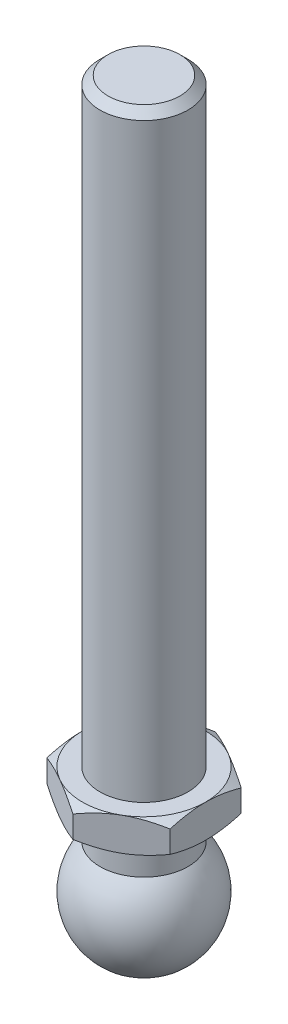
ISO-10303-21;
HEADER;
FILE_DESCRIPTION(('STEP AP214'),'2;1');
FILE_NAME('part.step','',(''),(''),'','','');
FILE_SCHEMA(('AUTOMOTIVE_DESIGN { 1 0 10303 214 1 1 1 1 }'));
ENDSEC;
DATA;
#1=APPLICATION_CONTEXT('core data for automotive mechanical design processes');
#2=APPLICATION_PROTOCOL_DEFINITION('international standard','automotive_design',2000,#1);
#3=PRODUCT_CONTEXT('',#1,'mechanical');
#4=PRODUCT('Part','Part','',(#3));
#5=PRODUCT_RELATED_PRODUCT_CATEGORY('part','',(#4));
#6=PRODUCT_DEFINITION_FORMATION('','',#4);
#7=PRODUCT_DEFINITION_CONTEXT('part definition',#1,'design');
#8=PRODUCT_DEFINITION('design','',#6,#7);
#9=PRODUCT_DEFINITION_SHAPE('','',#8);
#10=(LENGTH_UNIT() NAMED_UNIT(*) SI_UNIT(.MILLI.,.METRE.));
#11=(NAMED_UNIT(*) PLANE_ANGLE_UNIT() SI_UNIT($,.RADIAN.));
#12=(NAMED_UNIT(*) SI_UNIT($,.STERADIAN.) SOLID_ANGLE_UNIT());
#13=UNCERTAINTY_MEASURE_WITH_UNIT(LENGTH_MEASURE(1.E-05),#10,'distance_accuracy_value','');
#14=(GEOMETRIC_REPRESENTATION_CONTEXT(3) GLOBAL_UNCERTAINTY_ASSIGNED_CONTEXT((#13)) GLOBAL_UNIT_ASSIGNED_CONTEXT((#10,
#11,#12)) REPRESENTATION_CONTEXT('',''));
#15=CARTESIAN_POINT('',(0.,0.,0.));
#16=DIRECTION('',(0.,0.,1.));
#17=DIRECTION('',(1.,0.,0.));
#18=AXIS2_PLACEMENT_3D('',#15,#16,#17);
#19=CARTESIAN_POINT('',(0.,12.25,0.));
#20=DIRECTION('',(0.,-1.,0.));
#21=DIRECTION('',(0.,0.,-1.));
#22=AXIS2_PLACEMENT_3D('',#19,#20,#21);
#23=CONICAL_SURFACE('',#22,7.,1.0471975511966);
#24=CARTESIAN_POINT('',(-7.,8.18828268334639,12.1648696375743));
#25=CARTESIAN_POINT('',(-7.,8.33391573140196,11.8738003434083));
#26=CARTESIAN_POINT('',(-7.,8.47854589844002,11.5822239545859));
#27=CARTESIAN_POINT('',(-7.,8.76531569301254,10.997825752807));
#28=CARTESIAN_POINT('',(-7.,8.90745515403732,10.7050038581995));
#29=CARTESIAN_POINT('',(-7.,9.18902214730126,10.117331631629));
#30=CARTESIAN_POINT('',(-7.,9.32844364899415,9.82247840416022));
#31=CARTESIAN_POINT('',(-7.,9.60360604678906,9.23106328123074));
#32=CARTESIAN_POINT('',(-7.,9.73934701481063,8.93450141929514));
#33=CARTESIAN_POINT('',(-7.,10.0123110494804,8.32593520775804));
#34=CARTESIAN_POINT('',(-7.,10.149325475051,8.01383696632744));
#35=CARTESIAN_POINT('',(-7.,10.4171383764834,7.38695797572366));
#36=CARTESIAN_POINT('',(-7.,10.5479365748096,7.07217710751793));
#37=CARTESIAN_POINT('',(-7.,10.8015530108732,6.43962449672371));
#38=CARTESIAN_POINT('',(-7.,10.924376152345,6.1218547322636));
#39=CARTESIAN_POINT('',(-7.,11.1599016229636,5.48260317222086));
#40=CARTESIAN_POINT('',(-7.,11.2726050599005,5.1611217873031));
#41=CARTESIAN_POINT('',(-7.,11.5099014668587,4.4382173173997));
#42=CARTESIAN_POINT('',(-7.,11.6311181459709,4.03566892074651));
#43=CARTESIAN_POINT('',(-7.,11.8469740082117,3.22331060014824));
#44=CARTESIAN_POINT('',(-7.,11.9416155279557,2.81350131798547));
#45=CARTESIAN_POINT('',(-7.,12.0569999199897,2.19742561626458));
#46=CARTESIAN_POINT('',(-7.,12.0908518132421,1.99359214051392));
#47=CARTESIAN_POINT('',(-7.,12.1493191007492,1.5846161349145));
#48=CARTESIAN_POINT('',(-7.,12.1739358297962,1.37947379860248));
#49=CARTESIAN_POINT('',(-7.,12.2131968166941,0.968289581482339));
#50=CARTESIAN_POINT('',(-7.,12.2278439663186,0.762247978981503));
#51=CARTESIAN_POINT('',(-7.,12.2467021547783,0.349683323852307));
#52=CARTESIAN_POINT('',(-7.,12.2509132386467,0.143160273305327));
#53=CARTESIAN_POINT('',(-7.,12.2487493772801,-0.271082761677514));
#54=CARTESIAN_POINT('',(-7.,12.2423100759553,-0.478802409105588));
#55=CARTESIAN_POINT('',(-7.,12.2189433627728,-0.893645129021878));
#56=CARTESIAN_POINT('',(-7.,12.2020159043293,-1.10076819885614));
#57=CARTESIAN_POINT('',(-7.,12.1582124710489,-1.51403043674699));
#58=CARTESIAN_POINT('',(-7.,12.1313327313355,-1.72016920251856));
#59=CARTESIAN_POINT('',(-7.,12.0684180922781,-2.13103319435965));
#60=CARTESIAN_POINT('',(-7.,12.0323828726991,-2.33575837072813));
#61=CARTESIAN_POINT('',(-7.,11.9105686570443,-2.95437912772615));
#62=CARTESIAN_POINT('',(-7.,11.8118729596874,-3.36575077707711));
#63=CARTESIAN_POINT('',(-7.,11.5884533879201,-4.18138012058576));
#64=CARTESIAN_POINT('',(-7.,11.4637148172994,-4.58563365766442));
#65=CARTESIAN_POINT('',(-7.,11.2233248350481,-5.3032089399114));
#66=CARTESIAN_POINT('',(-7.,11.1112875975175,-5.61775957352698));
#67=CARTESIAN_POINT('',(-7.,10.8778514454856,-6.2432502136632));
#68=CARTESIAN_POINT('',(-7.,10.7564551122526,-6.55419118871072));
#69=CARTESIAN_POINT('',(-7.,10.5062070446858,-7.17328528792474));
#70=CARTESIAN_POINT('',(-7.,10.3773503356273,-7.48143638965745));
#71=CARTESIAN_POINT('',(-7.,10.1137823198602,-8.09523802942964));
#72=CARTESIAN_POINT('',(-7.,9.97907065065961,-8.40088841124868));
#73=CARTESIAN_POINT('',(-7.,9.71078407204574,-8.99716345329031));
#74=CARTESIAN_POINT('',(-7.,9.57740317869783,-9.28787568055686));
#75=CARTESIAN_POINT('',(-7.,9.30714715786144,-9.86766295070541));
#76=CARTESIAN_POINT('',(-7.,9.17027208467,-10.1567380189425));
#77=CARTESIAN_POINT('',(-7.,8.89389786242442,-10.7329937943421));
#78=CARTESIAN_POINT('',(-7.,8.75440383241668,-11.0201769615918));
#79=CARTESIAN_POINT('',(-7.,8.47302286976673,-11.5933594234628));
#80=CARTESIAN_POINT('',(-7.,8.3311360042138,-11.879358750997));
#81=CARTESIAN_POINT('',(-7.,8.18828268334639,-12.1648696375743));
#82=B_SPLINE_CURVE_WITH_KNOTS('',3,(#24,#25,#26,#27,#28,#29,#30,#31,#32,#33,#34,#35,#36,#37,#38,
#39,#40,#41,#42,#43,#44,#45,#46,#47,#48,#49,#50,#51,#52,#53,#54,#55,#56,#57,#58,#59,#60,#61,#62,
#63,#64,#65,#66,#67,#68,#69,#70,#71,#72,#73,#74,#75,#76,#77,#78,#79,#80,#81),.UNSPECIFIED.,.F.,
.F.,(4,2,2,2,2,2,2,2,2,2,2,2,2,2,2,2,2,2,2,2,2,2,2,2,2,2,2,2,4),(0.,0.976413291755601,
1.95289161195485,2.93133423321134,3.90975772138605,4.93225217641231,5.95479223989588,
6.97669748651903,7.99849072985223,9.25906449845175,10.5195273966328,11.1392271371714,
11.7588372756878,12.3782676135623,12.9976952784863,13.6208795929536,14.2440666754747,
14.8674897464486,15.4909346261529,16.7587972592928,18.0273773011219,19.0289263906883,
20.0302002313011,21.0321496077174,22.0341611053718,22.9936838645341,23.9531917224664,
24.9109871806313,25.8687558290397),.UNSPECIFIED.);
#83=CARTESIAN_POINT('',(-7.,11.6247852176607,4.04145188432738));
#84=VERTEX_POINT('',#83);
#85=CARTESIAN_POINT('',(-7.,12.25,0.));
#86=VERTEX_POINT('',#85);
#87=EDGE_CURVE('E309',#84,#86,#82,.T.);
#88=ORIENTED_EDGE('',*,*,#87,.F.);
#89=CARTESIAN_POINT('',(0.0002,11.6247185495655,8.0830192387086));
#90=CARTESIAN_POINT('',(-0.153667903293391,11.6760001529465,7.99418356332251));
#91=CARTESIAN_POINT('',(-0.308109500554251,11.7249544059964,7.90501666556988));
#92=CARTESIAN_POINT('',(-0.618246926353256,11.8175672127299,7.72595873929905));
#93=CARTESIAN_POINT('',(-0.773943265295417,11.8612234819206,7.63606741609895));
#94=CARTESIAN_POINT('',(-1.24352516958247,11.9833884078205,7.36495417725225));
#95=CARTESIAN_POINT('',(-1.5592643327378,12.052874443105,7.18266208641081));
#96=CARTESIAN_POINT('',(-2.03176224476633,12.1343550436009,6.9098652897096));
#97=CARTESIAN_POINT('',(-2.18710922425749,12.1575665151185,6.82017566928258));
#98=CARTESIAN_POINT('',(-2.49850511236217,12.1964887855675,6.64039116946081));
#99=CARTESIAN_POINT('',(-2.65455395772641,12.2122002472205,6.55029632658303));
#100=CARTESIAN_POINT('',(-2.96692267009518,12.2357220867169,6.3699501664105));
#101=CARTESIAN_POINT('',(-3.12324202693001,12.2435414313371,6.27969914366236));
#102=CARTESIAN_POINT('',(-3.43601650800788,12.2511197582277,6.09911871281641));
#103=CARTESIAN_POINT('',(-3.59247162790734,12.250878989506,6.00878930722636));
#104=CARTESIAN_POINT('',(-4.02110687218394,12.2391402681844,5.76131663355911));
#105=CARTESIAN_POINT('',(-4.2931466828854,12.2194342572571,5.60425437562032));
#106=CARTESIAN_POINT('',(-4.8354194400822,12.1569465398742,5.29117305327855));
#107=CARTESIAN_POINT('',(-5.10565047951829,12.114143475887,5.13515508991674));
#108=CARTESIAN_POINT('',(-5.64901454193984,12.0071483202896,4.82144370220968));
#109=CARTESIAN_POINT('',(-5.92207900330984,11.9425029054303,4.66378986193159));
#110=CARTESIAN_POINT('',(-6.46413578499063,11.795783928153,4.35083323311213));
#111=CARTESIAN_POINT('',(-6.73313504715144,11.7137448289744,4.19552643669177));
#112=CARTESIAN_POINT('',(-7.0002,11.6247185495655,4.04133641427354));
#113=B_SPLINE_CURVE_WITH_KNOTS('',3,(#89,#90,#91,#92,#93,#94,#95,#96,#97,#98,#99,#100,#101,#102,
#103,#104,#105,#106,#107,#108,#109,#110,#111,#112),.UNSPECIFIED.,.F.,.F.,(4,2,2,2,2,2,2,2,2,2,2,
4),(0.,0.554727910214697,1.10969417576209,2.2219327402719,2.76443041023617,3.30688013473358,
3.84871284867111,4.3905288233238,5.33376515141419,6.27787517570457,7.2429241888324,
8.20607866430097),.UNSPECIFIED.);
#114=CARTESIAN_POINT('',(-3.5,12.25,6.06217782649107));
#115=VERTEX_POINT('',#114);
#116=EDGE_CURVE('E135',#115,#84,#113,.T.);
#117=ORIENTED_EDGE('',*,*,#116,.F.);
#118=CARTESIAN_POINT('',(0.,12.25,0.));
#119=DIRECTION('',(0.,-1.,0.));
#120=DIRECTION('',(0.,0.,-1.));
#121=AXIS2_PLACEMENT_3D('',#118,#119,#120);
#122=CIRCLE('',#121,7.);
#123=EDGE_CURVE('E283',#115,#86,#122,.T.);
#124=ORIENTED_EDGE('',*,*,#123,.T.);
#125=EDGE_LOOP('',(#88,#117,#124));
#126=FACE_BOUND('',#125,.T.);
#127=ADVANCED_FACE('F14',(#126),#23,.T.);
#128=CARTESIAN_POINT('',(-7.,11.6247852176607,-4.04145188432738));
#129=VERTEX_POINT('',#128);
#130=EDGE_CURVE('E193',#86,#129,#82,.T.);
#131=ORIENTED_EDGE('',*,*,#130,.F.);
#132=CARTESIAN_POINT('',(-3.5,12.25,-6.06217782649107));
#133=VERTEX_POINT('',#132);
#134=EDGE_CURVE('E195',#86,#133,#122,.T.);
#135=ORIENTED_EDGE('',*,*,#134,.T.);
#136=CARTESIAN_POINT('',(-7.0002,11.6247185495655,-4.04133641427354));
#137=CARTESIAN_POINT('',(-6.84633209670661,11.6760001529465,-4.13017208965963));
#138=CARTESIAN_POINT('',(-6.69189049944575,11.7249544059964,-4.21933898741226));
#139=CARTESIAN_POINT('',(-6.38175307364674,11.8175672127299,-4.39839691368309));
#140=CARTESIAN_POINT('',(-6.22605673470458,11.8612234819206,-4.48828823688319));
#141=CARTESIAN_POINT('',(-5.75647483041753,11.9833884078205,-4.75940147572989));
#142=CARTESIAN_POINT('',(-5.44073566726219,12.052874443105,-4.94169356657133));
#143=CARTESIAN_POINT('',(-4.96823775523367,12.1343550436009,-5.21449036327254));
#144=CARTESIAN_POINT('',(-4.81289077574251,12.1575665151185,-5.30417998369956));
#145=CARTESIAN_POINT('',(-4.50149488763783,12.1964887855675,-5.48396448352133));
#146=CARTESIAN_POINT('',(-4.34544604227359,12.2122002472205,-5.57405932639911));
#147=CARTESIAN_POINT('',(-4.03307732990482,12.2357220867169,-5.75440548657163));
#148=CARTESIAN_POINT('',(-3.87675797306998,12.2435414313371,-5.84465650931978));
#149=CARTESIAN_POINT('',(-3.56398349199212,12.2511197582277,-6.02523694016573));
#150=CARTESIAN_POINT('',(-3.40752837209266,12.250878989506,-6.11556634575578));
#151=CARTESIAN_POINT('',(-2.97889312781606,12.2391402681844,-6.36303901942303));
#152=CARTESIAN_POINT('',(-2.70685331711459,12.2194342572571,-6.52010127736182));
#153=CARTESIAN_POINT('',(-2.1645805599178,12.1569465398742,-6.83318259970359));
#154=CARTESIAN_POINT('',(-1.89434952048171,12.114143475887,-6.9892005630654));
#155=CARTESIAN_POINT('',(-1.35098545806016,12.0071483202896,-7.30291195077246));
#156=CARTESIAN_POINT('',(-1.07792099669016,11.9425029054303,-7.46056579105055));
#157=CARTESIAN_POINT('',(-0.535864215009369,11.795783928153,-7.77352241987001));
#158=CARTESIAN_POINT('',(-0.266864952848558,11.7137448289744,-7.92882921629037));
#159=CARTESIAN_POINT('',(0.000199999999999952,11.6247185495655,-8.0830192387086));
#160=B_SPLINE_CURVE_WITH_KNOTS('',3,(#136,#137,#138,#139,#140,#141,#142,#143,#144,#145,#146,
#147,#148,#149,#150,#151,#152,#153,#154,#155,#156,#157,#158,#159),.UNSPECIFIED.,.F.,.F.,(4,2,2,
2,2,2,2,2,2,2,2,4),(0.,0.554727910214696,1.10969417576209,2.2219327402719,2.76443041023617,
3.30688013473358,3.8487128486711,4.3905288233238,5.33376515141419,6.27787517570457,
7.2429241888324,8.20607866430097),.UNSPECIFIED.);
#161=EDGE_CURVE('E183',#129,#133,#160,.T.);
#162=ORIENTED_EDGE('',*,*,#161,.F.);
#163=EDGE_LOOP('',(#131,#135,#162));
#164=FACE_BOUND('',#163,.T.);
#165=ADVANCED_FACE('F192',(#164),#23,.T.);
#166=CARTESIAN_POINT('',(0.,11.6247852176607,-8.08290376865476));
#167=VERTEX_POINT('',#166);
#168=EDGE_CURVE('E197',#133,#167,#160,.T.);
#169=ORIENTED_EDGE('',*,*,#168,.F.);
#170=CARTESIAN_POINT('',(3.5,12.25,-6.06217782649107));
#171=VERTEX_POINT('',#170);
#172=EDGE_CURVE('E293',#133,#171,#122,.T.);
#173=ORIENTED_EDGE('',*,*,#172,.T.);
#174=CARTESIAN_POINT('',(-0.0002,11.6247185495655,-8.0830192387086));
#175=CARTESIAN_POINT('',(0.153667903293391,11.6760001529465,-7.99418356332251));
#176=CARTESIAN_POINT('',(0.308109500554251,11.7249544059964,-7.90501666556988));
#177=CARTESIAN_POINT('',(0.618246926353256,11.8175672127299,-7.72595873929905));
#178=CARTESIAN_POINT('',(0.773943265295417,11.8612234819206,-7.63606741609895));
#179=CARTESIAN_POINT('',(1.24352516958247,11.9833884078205,-7.36495417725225));
#180=CARTESIAN_POINT('',(1.5592643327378,12.052874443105,-7.18266208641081));
#181=CARTESIAN_POINT('',(2.03176224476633,12.1343550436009,-6.9098652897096));
#182=CARTESIAN_POINT('',(2.18710922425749,12.1575665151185,-6.82017566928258));
#183=CARTESIAN_POINT('',(2.49850511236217,12.1964887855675,-6.64039116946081));
#184=CARTESIAN_POINT('',(2.65455395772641,12.2122002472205,-6.55029632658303));
#185=CARTESIAN_POINT('',(2.96692267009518,12.2357220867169,-6.3699501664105));
#186=CARTESIAN_POINT('',(3.12324202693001,12.2435414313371,-6.27969914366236));
#187=CARTESIAN_POINT('',(3.43601650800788,12.2511197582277,-6.09911871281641));
#188=CARTESIAN_POINT('',(3.59247162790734,12.250878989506,-6.00878930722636));
#189=CARTESIAN_POINT('',(4.02110687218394,12.2391402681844,-5.76131663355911));
#190=CARTESIAN_POINT('',(4.2931466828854,12.2194342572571,-5.60425437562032));
#191=CARTESIAN_POINT('',(4.8354194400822,12.1569465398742,-5.29117305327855));
#192=CARTESIAN_POINT('',(5.10565047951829,12.114143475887,-5.13515508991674));
#193=CARTESIAN_POINT('',(5.64901454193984,12.0071483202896,-4.82144370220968));
#194=CARTESIAN_POINT('',(5.92207900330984,11.9425029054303,-4.66378986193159));
#195=CARTESIAN_POINT('',(6.46413578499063,11.795783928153,-4.35083323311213));
#196=CARTESIAN_POINT('',(6.73313504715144,11.7137448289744,-4.19552643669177));
#197=CARTESIAN_POINT('',(7.0002,11.6247185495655,-4.04133641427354));
#198=B_SPLINE_CURVE_WITH_KNOTS('',3,(#174,#175,#176,#177,#178,#179,#180,#181,#182,#183,#184,
#185,#186,#187,#188,#189,#190,#191,#192,#193,#194,#195,#196,#197),.UNSPECIFIED.,.F.,.F.,(4,2,2,
2,2,2,2,2,2,2,2,4),(0.,0.554727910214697,1.10969417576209,2.2219327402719,2.76443041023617,
3.30688013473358,3.84871284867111,4.3905288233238,5.33376515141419,6.27787517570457,
7.2429241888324,8.20607866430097),.UNSPECIFIED.);
#199=EDGE_CURVE('E243',#167,#171,#198,.T.);
#200=ORIENTED_EDGE('',*,*,#199,.F.);
#201=EDGE_LOOP('',(#169,#173,#200));
#202=FACE_BOUND('',#201,.T.);
#203=ADVANCED_FACE('F342',(#202),#23,.T.);
#204=CARTESIAN_POINT('',(7.,11.6247852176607,-4.04145188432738));
#205=VERTEX_POINT('',#204);
#206=EDGE_CURVE('E238',#171,#205,#198,.T.);
#207=ORIENTED_EDGE('',*,*,#206,.F.);
#208=CARTESIAN_POINT('',(7.,12.25,0.));
#209=VERTEX_POINT('',#208);
#210=EDGE_CURVE('E288',#171,#209,#122,.T.);
#211=ORIENTED_EDGE('',*,*,#210,.T.);
#212=CARTESIAN_POINT('',(7.,8.18828268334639,-12.1648696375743));
#213=CARTESIAN_POINT('',(7.,8.33391573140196,-11.8738003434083));
#214=CARTESIAN_POINT('',(7.,8.47854589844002,-11.5822239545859));
#215=CARTESIAN_POINT('',(7.,8.76531569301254,-10.997825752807));
#216=CARTESIAN_POINT('',(7.,8.90745515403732,-10.7050038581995));
#217=CARTESIAN_POINT('',(7.,9.18902214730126,-10.117331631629));
#218=CARTESIAN_POINT('',(7.,9.32844364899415,-9.82247840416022));
#219=CARTESIAN_POINT('',(7.,9.60360604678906,-9.23106328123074));
#220=CARTESIAN_POINT('',(7.,9.73934701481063,-8.93450141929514));
#221=CARTESIAN_POINT('',(7.,10.0123110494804,-8.32593520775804));
#222=CARTESIAN_POINT('',(7.,10.149325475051,-8.01383696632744));
#223=CARTESIAN_POINT('',(7.,10.4171383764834,-7.38695797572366));
#224=CARTESIAN_POINT('',(7.,10.5479365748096,-7.07217710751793));
#225=CARTESIAN_POINT('',(7.,10.8015530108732,-6.43962449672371));
#226=CARTESIAN_POINT('',(7.,10.924376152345,-6.1218547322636));
#227=CARTESIAN_POINT('',(7.,11.1599016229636,-5.48260317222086));
#228=CARTESIAN_POINT('',(7.,11.2726050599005,-5.1611217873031));
#229=CARTESIAN_POINT('',(7.,11.5099014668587,-4.4382173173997));
#230=CARTESIAN_POINT('',(7.,11.6311181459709,-4.03566892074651));
#231=CARTESIAN_POINT('',(7.,11.8469740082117,-3.22331060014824));
#232=CARTESIAN_POINT('',(7.,11.9416155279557,-2.81350131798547));
#233=CARTESIAN_POINT('',(7.,12.0569999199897,-2.19742561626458));
#234=CARTESIAN_POINT('',(7.,12.0908518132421,-1.99359214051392));
#235=CARTESIAN_POINT('',(7.,12.1493191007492,-1.5846161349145));
#236=CARTESIAN_POINT('',(7.,12.1739358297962,-1.37947379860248));
#237=CARTESIAN_POINT('',(7.,12.2131968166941,-0.968289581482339));
#238=CARTESIAN_POINT('',(7.,12.2278439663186,-0.762247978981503));
#239=CARTESIAN_POINT('',(7.,12.2467021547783,-0.349683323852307));
#240=CARTESIAN_POINT('',(7.,12.2509132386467,-0.143160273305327));
#241=CARTESIAN_POINT('',(7.,12.2487493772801,0.271082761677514));
#242=CARTESIAN_POINT('',(7.,12.2423100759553,0.478802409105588));
#243=CARTESIAN_POINT('',(7.,12.2189433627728,0.893645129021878));
#244=CARTESIAN_POINT('',(7.,12.2020159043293,1.10076819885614));
#245=CARTESIAN_POINT('',(7.,12.1582124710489,1.51403043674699));
#246=CARTESIAN_POINT('',(7.,12.1313327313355,1.72016920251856));
#247=CARTESIAN_POINT('',(7.,12.0684180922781,2.13103319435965));
#248=CARTESIAN_POINT('',(7.,12.0323828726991,2.33575837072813));
#249=CARTESIAN_POINT('',(7.,11.9105686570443,2.95437912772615));
#250=CARTESIAN_POINT('',(7.,11.8118729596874,3.36575077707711));
#251=CARTESIAN_POINT('',(7.,11.5884533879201,4.18138012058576));
#252=CARTESIAN_POINT('',(7.,11.4637148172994,4.58563365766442));
#253=CARTESIAN_POINT('',(7.,11.2233248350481,5.3032089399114));
#254=CARTESIAN_POINT('',(7.,11.1112875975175,5.61775957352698));
#255=CARTESIAN_POINT('',(7.,10.8778514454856,6.2432502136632));
#256=CARTESIAN_POINT('',(7.,10.7564551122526,6.55419118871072));
#257=CARTESIAN_POINT('',(7.,10.5062070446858,7.17328528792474));
#258=CARTESIAN_POINT('',(7.,10.3773503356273,7.48143638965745));
#259=CARTESIAN_POINT('',(7.,10.1137823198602,8.09523802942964));
#260=CARTESIAN_POINT('',(7.,9.97907065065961,8.40088841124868));
#261=CARTESIAN_POINT('',(7.,9.71078407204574,8.99716345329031));
#262=CARTESIAN_POINT('',(7.,9.57740317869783,9.28787568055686));
#263=CARTESIAN_POINT('',(7.,9.30714715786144,9.86766295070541));
#264=CARTESIAN_POINT('',(7.,9.17027208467,10.1567380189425));
#265=CARTESIAN_POINT('',(7.,8.89389786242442,10.7329937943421));
#266=CARTESIAN_POINT('',(7.,8.75440383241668,11.0201769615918));
#267=CARTESIAN_POINT('',(7.,8.47302286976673,11.5933594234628));
#268=CARTESIAN_POINT('',(7.,8.3311360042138,11.879358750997));
#269=CARTESIAN_POINT('',(7.,8.18828268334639,12.1648696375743));
#270=B_SPLINE_CURVE_WITH_KNOTS('',3,(#212,#213,#214,#215,#216,#217,#218,#219,#220,#221,#222,
#223,#224,#225,#226,#227,#228,#229,#230,#231,#232,#233,#234,#235,#236,#237,#238,#239,#240,#241,
#242,#243,#244,#245,#246,#247,#248,#249,#250,#251,#252,#253,#254,#255,#256,#257,#258,#259,#260,
#261,#262,#263,#264,#265,#266,#267,#268,#269),.UNSPECIFIED.,.F.,.F.,(4,2,2,2,2,2,2,2,2,2,2,2,2,
2,2,2,2,2,2,2,2,2,2,2,2,2,2,2,4),(0.,0.976413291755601,1.95289161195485,2.93133423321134,
3.90975772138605,4.93225217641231,5.95479223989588,6.97669748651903,7.99849072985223,
9.25906449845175,10.5195273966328,11.1392271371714,11.7588372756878,12.3782676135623,
12.9976952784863,13.6208795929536,14.2440666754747,14.8674897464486,15.4909346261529,
16.7587972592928,18.0273773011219,19.0289263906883,20.0302002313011,21.0321496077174,
22.0341611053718,22.9936838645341,23.9531917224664,24.9109871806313,25.8687558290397),.UNSPECIFIED.);
#271=EDGE_CURVE('E249',#205,#209,#270,.T.);
#272=ORIENTED_EDGE('',*,*,#271,.F.);
#273=EDGE_LOOP('',(#207,#211,#272));
#274=FACE_BOUND('',#273,.T.);
#275=ADVANCED_FACE('F352',(#274),#23,.T.);
#276=CARTESIAN_POINT('',(7.,11.6247852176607,4.04145188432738));
#277=VERTEX_POINT('',#276);
#278=EDGE_CURVE('E251',#209,#277,#270,.T.);
#279=ORIENTED_EDGE('',*,*,#278,.F.);
#280=CARTESIAN_POINT('',(3.5,12.25,6.06217782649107));
#281=VERTEX_POINT('',#280);
#282=EDGE_CURVE('E281',#209,#281,#122,.T.);
#283=ORIENTED_EDGE('',*,*,#282,.T.);
#284=CARTESIAN_POINT('',(7.0002,11.6247185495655,4.04133641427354));
#285=CARTESIAN_POINT('',(6.84633209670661,11.6760001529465,4.13017208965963));
#286=CARTESIAN_POINT('',(6.69189049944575,11.7249544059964,4.21933898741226));
#287=CARTESIAN_POINT('',(6.38175307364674,11.8175672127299,4.39839691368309));
#288=CARTESIAN_POINT('',(6.22605673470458,11.8612234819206,4.48828823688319));
#289=CARTESIAN_POINT('',(5.75647483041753,11.9833884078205,4.75940147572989));
#290=CARTESIAN_POINT('',(5.44073566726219,12.052874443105,4.94169356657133));
#291=CARTESIAN_POINT('',(4.96823775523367,12.1343550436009,5.21449036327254));
#292=CARTESIAN_POINT('',(4.81289077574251,12.1575665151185,5.30417998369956));
#293=CARTESIAN_POINT('',(4.50149488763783,12.1964887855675,5.48396448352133));
#294=CARTESIAN_POINT('',(4.34544604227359,12.2122002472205,5.57405932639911));
#295=CARTESIAN_POINT('',(4.03307732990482,12.2357220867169,5.75440548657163));
#296=CARTESIAN_POINT('',(3.87675797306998,12.2435414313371,5.84465650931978));
#297=CARTESIAN_POINT('',(3.56398349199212,12.2511197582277,6.02523694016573));
#298=CARTESIAN_POINT('',(3.40752837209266,12.250878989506,6.11556634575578));
#299=CARTESIAN_POINT('',(2.97889312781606,12.2391402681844,6.36303901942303));
#300=CARTESIAN_POINT('',(2.70685331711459,12.2194342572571,6.52010127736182));
#301=CARTESIAN_POINT('',(2.1645805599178,12.1569465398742,6.83318259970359));
#302=CARTESIAN_POINT('',(1.89434952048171,12.114143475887,6.9892005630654));
#303=CARTESIAN_POINT('',(1.35098545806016,12.0071483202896,7.30291195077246));
#304=CARTESIAN_POINT('',(1.07792099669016,11.9425029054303,7.46056579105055));
#305=CARTESIAN_POINT('',(0.535864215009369,11.795783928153,7.77352241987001));
#306=CARTESIAN_POINT('',(0.266864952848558,11.7137448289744,7.92882921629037));
#307=CARTESIAN_POINT('',(-0.000199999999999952,11.6247185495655,8.0830192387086));
#308=B_SPLINE_CURVE_WITH_KNOTS('',3,(#284,#285,#286,#287,#288,#289,#290,#291,#292,#293,#294,
#295,#296,#297,#298,#299,#300,#301,#302,#303,#304,#305,#306,#307),.UNSPECIFIED.,.F.,.F.,(4,2,2,
2,2,2,2,2,2,2,2,4),(0.,0.554727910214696,1.10969417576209,2.2219327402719,2.76443041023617,
3.30688013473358,3.8487128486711,4.3905288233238,5.33376515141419,6.27787517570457,
7.2429241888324,8.20607866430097),.UNSPECIFIED.);
#309=EDGE_CURVE('E126',#277,#281,#308,.T.);
#310=ORIENTED_EDGE('',*,*,#309,.F.);
#311=EDGE_LOOP('',(#279,#283,#310));
#312=FACE_BOUND('',#311,.T.);
#313=ADVANCED_FACE('F285',(#312),#23,.T.);
#314=CARTESIAN_POINT('',(0.,11.6247852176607,8.08290376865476));
#315=VERTEX_POINT('',#314);
#316=EDGE_CURVE('E116',#281,#315,#308,.T.);
#317=ORIENTED_EDGE('',*,*,#316,.F.);
#318=EDGE_CURVE('E274',#281,#115,#122,.T.);
#319=ORIENTED_EDGE('',*,*,#318,.T.);
#320=EDGE_CURVE('E29',#315,#115,#113,.T.);
#321=ORIENTED_EDGE('',*,*,#320,.F.);
#322=EDGE_LOOP('',(#317,#319,#321));
#323=FACE_BOUND('',#322,.T.);
#324=ADVANCED_FACE('F273',(#323),#23,.T.);
#325=CARTESIAN_POINT('',(0.,80.25,0.));
#326=DIRECTION('',(0.,-1.,0.));
#327=DIRECTION('',(0.,0.,-1.));
#328=AXIS2_PLACEMENT_3D('',#325,#326,#327);
#329=PLANE('',#328);
#330=CARTESIAN_POINT('',(0.,80.25,0.));
#331=DIRECTION('',(0.,-1.,0.));
#332=DIRECTION('',(0.,0.,-1.));
#333=AXIS2_PLACEMENT_3D('',#330,#331,#332);
#334=CIRCLE('',#333,4.08);
#335=CARTESIAN_POINT('',(0.,80.25,-4.08));
#336=VERTEX_POINT('',#335);
#337=EDGE_CURVE('E22',#336,#336,#334,.T.);
#338=ORIENTED_EDGE('',*,*,#337,.F.);
#339=EDGE_LOOP('',(#338));
#340=FACE_BOUND('',#339,.T.);
#341=ADVANCED_FACE('F16',(#340),#329,.F.);
#342=CARTESIAN_POINT('',(0.,80.25,0.));
#343=DIRECTION('',(0.,-1.,0.));
#344=DIRECTION('',(0.,0.,-1.));
#345=AXIS2_PLACEMENT_3D('',#342,#343,#344);
#346=CONICAL_SURFACE('',#345,4.08,0.785398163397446);
#347=CARTESIAN_POINT('',(0.,79.33,0.));
#348=DIRECTION('',(0.,-1.,0.));
#349=DIRECTION('',(0.,0.,-1.));
#350=AXIS2_PLACEMENT_3D('',#347,#348,#349);
#351=CIRCLE('',#350,5.);
#352=CARTESIAN_POINT('',(0.,79.33,-5.));
#353=VERTEX_POINT('',#352);
#354=EDGE_CURVE('E290',#353,#353,#351,.T.);
#355=ORIENTED_EDGE('',*,*,#354,.F.);
#356=EDGE_LOOP('',(#355));
#357=FACE_BOUND('',#356,.T.);
#358=ORIENTED_EDGE('',*,*,#337,.T.);
#359=EDGE_LOOP('',(#358));
#360=FACE_BOUND('',#359,.T.);
#361=ADVANCED_FACE('F350',(#357,#360),#346,.T.);
#362=CARTESIAN_POINT('',(0.,-7.,0.));
#363=DIRECTION('',(0.,-1.,0.));
#364=DIRECTION('',(0.,0.,-1.));
#365=AXIS2_PLACEMENT_3D('',#362,#363,#364);
#366=CYLINDRICAL_SURFACE('',#365,5.);
#367=CARTESIAN_POINT('',(0.,12.25,0.));
#368=DIRECTION('',(0.,-1.,0.));
#369=DIRECTION('',(0.,0.,-1.));
#370=AXIS2_PLACEMENT_3D('',#367,#368,#369);
#371=CIRCLE('',#370,5.);
#372=CARTESIAN_POINT('',(0.,12.25,-5.));
#373=VERTEX_POINT('',#372);
#374=EDGE_CURVE('E287',#373,#373,#371,.T.);
#375=ORIENTED_EDGE('',*,*,#374,.F.);
#376=EDGE_LOOP('',(#375));
#377=FACE_BOUND('',#376,.T.);
#378=ORIENTED_EDGE('',*,*,#354,.T.);
#379=EDGE_LOOP('',(#378));
#380=FACE_BOUND('',#379,.T.);
#381=ADVANCED_FACE('F427',(#377,#380),#366,.T.);
#382=CARTESIAN_POINT('',(5.,12.25,0.));
#383=DIRECTION('',(0.,-1.,0.));
#384=DIRECTION('',(0.,0.,-1.));
#385=AXIS2_PLACEMENT_3D('',#382,#383,#384);
#386=PLANE('',#385);
#387=ORIENTED_EDGE('',*,*,#282,.F.);
#388=ORIENTED_EDGE('',*,*,#210,.F.);
#389=ORIENTED_EDGE('',*,*,#172,.F.);
#390=ORIENTED_EDGE('',*,*,#134,.F.);
#391=ORIENTED_EDGE('',*,*,#123,.F.);
#392=ORIENTED_EDGE('',*,*,#318,.F.);
#393=EDGE_LOOP('',(#387,#388,#389,#390,#391,#392));
#394=FACE_BOUND('',#393,.T.);
#395=ORIENTED_EDGE('',*,*,#374,.T.);
#396=EDGE_LOOP('',(#395));
#397=FACE_BOUND('',#396,.T.);
#398=ADVANCED_FACE('F278',(#394,#397),#386,.F.);
#399=CARTESIAN_POINT('',(-7.,8.5,-4.04145188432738));
#400=DIRECTION('',(-1.,0.,0.));
#401=DIRECTION('',(0.,0.,1.));
#402=AXIS2_PLACEMENT_3D('',#399,#400,#401);
#403=PLANE('',#402);
#404=ORIENTED_EDGE('',*,*,#87,.T.);
#405=ORIENTED_EDGE('',*,*,#130,.T.);
#406=DIRECTION('',(0.,1.,0.));
#407=VECTOR('',#406,1.);
#408=CARTESIAN_POINT('',(-7.,8.5,-4.04145188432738));
#409=LINE('',#408,#407);
#410=CARTESIAN_POINT('',(-7.,9.12521478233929,-4.04145188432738));
#411=VERTEX_POINT('',#410);
#412=EDGE_CURVE('E109',#411,#129,#409,.T.);
#413=ORIENTED_EDGE('',*,*,#412,.F.);
#414=CARTESIAN_POINT('',(-7.,12.5617173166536,-12.1648696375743));
#415=CARTESIAN_POINT('',(-7.,12.416084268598,-11.8738003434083));
#416=CARTESIAN_POINT('',(-7.,12.27145410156,-11.5822239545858));
#417=CARTESIAN_POINT('',(-7.,11.9846843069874,-10.997825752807));
#418=CARTESIAN_POINT('',(-7.,11.8425448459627,-10.7050038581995));
#419=CARTESIAN_POINT('',(-7.,11.5609778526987,-10.1173316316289));
#420=CARTESIAN_POINT('',(-7.,11.4215563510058,-9.82247840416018));
#421=CARTESIAN_POINT('',(-7.,11.1463939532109,-9.23106328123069));
#422=CARTESIAN_POINT('',(-7.,11.0106529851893,-8.93450141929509));
#423=CARTESIAN_POINT('',(-7.,10.7376889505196,-8.32593520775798));
#424=CARTESIAN_POINT('',(-7.,10.6006745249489,-8.01383696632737));
#425=CARTESIAN_POINT('',(-7.,10.3328616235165,-7.38695797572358));
#426=CARTESIAN_POINT('',(-7.,10.2020634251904,-7.07217710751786));
#427=CARTESIAN_POINT('',(-7.,9.94844698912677,-6.43962449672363));
#428=CARTESIAN_POINT('',(-7.,9.825623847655,-6.12185473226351));
#429=CARTESIAN_POINT('',(-7.,9.59009837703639,-5.48260317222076));
#430=CARTESIAN_POINT('',(-7.,9.47739494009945,-5.16112178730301));
#431=CARTESIAN_POINT('',(-7.,9.24009853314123,-4.4382173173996));
#432=CARTESIAN_POINT('',(-7.,9.11888185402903,-4.03566892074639));
#433=CARTESIAN_POINT('',(-7.,8.90302599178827,-3.22331060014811));
#434=CARTESIAN_POINT('',(-7.,8.80838447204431,-2.81350131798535));
#435=CARTESIAN_POINT('',(-7.,8.69300008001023,-2.19742561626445));
#436=CARTESIAN_POINT('',(-7.,8.65914818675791,-1.99359214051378));
#437=CARTESIAN_POINT('',(-7.,8.60068089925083,-1.58461613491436));
#438=CARTESIAN_POINT('',(-7.,8.5760641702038,-1.37947379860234));
#439=CARTESIAN_POINT('',(-7.,8.53680318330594,-0.968289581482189));
#440=CARTESIAN_POINT('',(-7.,8.52215603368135,-0.76224797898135));
#441=CARTESIAN_POINT('',(-7.,8.50329784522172,-0.349683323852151));
#442=CARTESIAN_POINT('',(-7.,8.49908676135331,-0.143160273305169));
#443=CARTESIAN_POINT('',(-7.,8.50125062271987,0.271082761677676));
#444=CARTESIAN_POINT('',(-7.,8.50768992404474,0.478802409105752));
#445=CARTESIAN_POINT('',(-7.,8.53105663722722,0.893645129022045));
#446=CARTESIAN_POINT('',(-7.,8.54798409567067,1.1007681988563));
#447=CARTESIAN_POINT('',(-7.,8.59178752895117,1.51403043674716));
#448=CARTESIAN_POINT('',(-7.,8.61866726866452,1.72016920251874));
#449=CARTESIAN_POINT('',(-7.,8.68158190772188,2.13103319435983));
#450=CARTESIAN_POINT('',(-7.,8.71761712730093,2.33575837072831));
#451=CARTESIAN_POINT('',(-7.,8.83943134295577,2.95437912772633));
#452=CARTESIAN_POINT('',(-7.,8.93812704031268,3.3657507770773));
#453=CARTESIAN_POINT('',(-7.,9.16154661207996,4.18138012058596));
#454=CARTESIAN_POINT('',(-7.,9.28628518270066,4.58563365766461));
#455=CARTESIAN_POINT('',(-7.,9.52667516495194,5.30320893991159));
#456=CARTESIAN_POINT('',(-7.,9.63871240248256,5.61775957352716));
#457=CARTESIAN_POINT('',(-7.,9.87214855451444,6.24325021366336));
#458=CARTESIAN_POINT('',(-7.,9.99354488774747,6.55419118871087));
#459=CARTESIAN_POINT('',(-7.,10.2437929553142,7.17328528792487));
#460=CARTESIAN_POINT('',(-7.,10.3726496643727,7.48143638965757));
#461=CARTESIAN_POINT('',(-7.,10.6362176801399,8.09523802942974));
#462=CARTESIAN_POINT('',(-7.,10.7709293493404,8.40088841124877));
#463=CARTESIAN_POINT('',(-7.,11.0392159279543,8.99716345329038));
#464=CARTESIAN_POINT('',(-7.,11.1725968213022,9.28787568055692));
#465=CARTESIAN_POINT('',(-7.,11.4428528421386,9.86766295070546));
#466=CARTESIAN_POINT('',(-7.,11.57972791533,10.1567380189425));
#467=CARTESIAN_POINT('',(-7.,11.8561021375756,10.7329937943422));
#468=CARTESIAN_POINT('',(-7.,11.9955961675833,11.0201769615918));
#469=CARTESIAN_POINT('',(-7.,12.2769771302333,11.5933594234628));
#470=CARTESIAN_POINT('',(-7.,12.4188639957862,11.879358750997));
#471=CARTESIAN_POINT('',(-7.,12.5617173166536,12.1648696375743));
#472=B_SPLINE_CURVE_WITH_KNOTS('',3,(#414,#415,#416,#417,#418,#419,#420,#421,#422,#423,#424,
#425,#426,#427,#428,#429,#430,#431,#432,#433,#434,#435,#436,#437,#438,#439,#440,#441,#442,#443,
#444,#445,#446,#447,#448,#449,#450,#451,#452,#453,#454,#455,#456,#457,#458,#459,#460,#461,#462,
#463,#464,#465,#466,#467,#468,#469,#470,#471),.UNSPECIFIED.,.F.,.F.,(4,2,2,2,2,2,2,2,2,2,2,2,2,
2,2,2,2,2,2,2,2,2,2,2,2,2,2,2,4),(0.,0.976413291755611,1.95289161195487,2.93133423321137,
3.90975772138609,4.93225217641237,5.95479223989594,6.97669748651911,7.99849072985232,
9.25906449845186,10.5195273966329,11.1392271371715,11.7588372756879,12.3782676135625,
12.9976952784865,13.6208795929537,14.2440666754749,14.8674897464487,15.490934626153,
16.758797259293,18.0273773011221,19.0289263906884,20.0302002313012,21.0321496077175,
22.0341611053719,22.9936838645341,23.9531917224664,24.9109871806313,25.8687558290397),.UNSPECIFIED.);
#473=CARTESIAN_POINT('',(-7.,8.5,0.));
#474=VERTEX_POINT('',#473);
#475=EDGE_CURVE('E199',#411,#474,#472,.T.);
#476=ORIENTED_EDGE('',*,*,#475,.T.);
#477=CARTESIAN_POINT('',(-7.,9.12521478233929,4.04145188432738));
#478=VERTEX_POINT('',#477);
#479=EDGE_CURVE('E196',#474,#478,#472,.T.);
#480=ORIENTED_EDGE('',*,*,#479,.T.);
#481=DIRECTION('',(0.,1.,0.));
#482=VECTOR('',#481,1.);
#483=CARTESIAN_POINT('',(-7.,8.5,4.04145188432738));
#484=LINE('',#483,#482);
#485=EDGE_CURVE('E118',#478,#84,#484,.T.);
#486=ORIENTED_EDGE('',*,*,#485,.T.);
#487=EDGE_LOOP('',(#404,#405,#413,#476,#480,#486));
#488=FACE_BOUND('',#487,.T.);
#489=ADVANCED_FACE('F224',(#488),#403,.T.);
#490=CARTESIAN_POINT('',(0.,8.5,-8.08290376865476));
#491=DIRECTION('',(-0.5,0.,-0.866025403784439));
#492=DIRECTION('',(-0.866025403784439,0.,0.5));
#493=AXIS2_PLACEMENT_3D('',#490,#491,#492);
#494=PLANE('',#493);
#495=ORIENTED_EDGE('',*,*,#161,.T.);
#496=ORIENTED_EDGE('',*,*,#168,.T.);
#497=DIRECTION('',(0.,1.,0.));
#498=VECTOR('',#497,1.);
#499=CARTESIAN_POINT('',(0.,8.5,-8.08290376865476));
#500=LINE('',#499,#498);
#501=CARTESIAN_POINT('',(0.,9.12521478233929,-8.08290376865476));
#502=VERTEX_POINT('',#501);
#503=EDGE_CURVE('E175',#502,#167,#500,.T.);
#504=ORIENTED_EDGE('',*,*,#503,.F.);
#505=CARTESIAN_POINT('',(0.0002,9.1252814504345,-8.0830192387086));
#506=CARTESIAN_POINT('',(-0.153667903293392,9.07399984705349,-7.99418356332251));
#507=CARTESIAN_POINT('',(-0.308109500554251,9.02504559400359,-7.90501666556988));
#508=CARTESIAN_POINT('',(-0.618246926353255,8.93243278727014,-7.72595873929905));
#509=CARTESIAN_POINT('',(-0.773943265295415,8.88877651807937,-7.63606741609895));
#510=CARTESIAN_POINT('',(-1.24352516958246,8.7666115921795,-7.36495417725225));
#511=CARTESIAN_POINT('',(-1.5592643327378,8.69712555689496,-7.18266208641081));
#512=CARTESIAN_POINT('',(-2.03176224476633,8.6156449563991,-6.9098652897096));
#513=CARTESIAN_POINT('',(-2.18710922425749,8.59243348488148,-6.82017566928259));
#514=CARTESIAN_POINT('',(-2.49850511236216,8.55351121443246,-6.64039116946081));
#515=CARTESIAN_POINT('',(-2.65455395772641,8.53779975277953,-6.55029632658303));
#516=CARTESIAN_POINT('',(-2.96692267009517,8.51427791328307,-6.36995016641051));
#517=CARTESIAN_POINT('',(-3.12324202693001,8.50645856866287,-6.27969914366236));
#518=CARTESIAN_POINT('',(-3.43601650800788,8.49888024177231,-6.09911871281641));
#519=CARTESIAN_POINT('',(-3.59247162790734,8.49912101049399,-6.00878930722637));
#520=CARTESIAN_POINT('',(-4.02110687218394,8.5108597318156,-5.76131663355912));
#521=CARTESIAN_POINT('',(-4.2931466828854,8.53056574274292,-5.60425437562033));
#522=CARTESIAN_POINT('',(-4.83541944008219,8.59305346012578,-5.29117305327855));
#523=CARTESIAN_POINT('',(-5.10565047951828,8.63585652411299,-5.13515508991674));
#524=CARTESIAN_POINT('',(-5.64901454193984,8.74285167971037,-4.82144370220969));
#525=CARTESIAN_POINT('',(-5.92207900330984,8.80749709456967,-4.66378986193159));
#526=CARTESIAN_POINT('',(-6.46413578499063,8.95421607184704,-4.35083323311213));
#527=CARTESIAN_POINT('',(-6.73313504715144,9.03625517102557,-4.19552643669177));
#528=CARTESIAN_POINT('',(-7.0002,9.1252814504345,-4.04133641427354));
#529=B_SPLINE_CURVE_WITH_KNOTS('',3,(#505,#506,#507,#508,#509,#510,#511,#512,#513,#514,#515,
#516,#517,#518,#519,#520,#521,#522,#523,#524,#525,#526,#527,#528),.UNSPECIFIED.,.F.,.F.,(4,2,2,
2,2,2,2,2,2,2,2,4),(0.,0.554727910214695,1.10969417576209,2.2219327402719,2.76443041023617,
3.30688013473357,3.8487128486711,4.39052882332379,5.33376515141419,6.27787517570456,
7.2429241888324,8.20607866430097),.UNSPECIFIED.);
#530=CARTESIAN_POINT('',(-3.5,8.5,-6.06217782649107));
#531=VERTEX_POINT('',#530);
#532=EDGE_CURVE('E201',#502,#531,#529,.T.);
#533=ORIENTED_EDGE('',*,*,#532,.T.);
#534=EDGE_CURVE('E186',#531,#411,#529,.T.);
#535=ORIENTED_EDGE('',*,*,#534,.T.);
#536=ORIENTED_EDGE('',*,*,#412,.T.);
#537=EDGE_LOOP('',(#495,#496,#504,#533,#535,#536));
#538=FACE_BOUND('',#537,.T.);
#539=ADVANCED_FACE('F182',(#538),#494,.T.);
#540=CARTESIAN_POINT('',(7.,8.5,-4.04145188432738));
#541=DIRECTION('',(0.5,0.,-0.866025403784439));
#542=DIRECTION('',(-0.866025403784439,0.,-0.5));
#543=AXIS2_PLACEMENT_3D('',#540,#541,#542);
#544=PLANE('',#543);
#545=ORIENTED_EDGE('',*,*,#199,.T.);
#546=ORIENTED_EDGE('',*,*,#206,.T.);
#547=DIRECTION('',(0.,1.,0.));
#548=VECTOR('',#547,1.);
#549=CARTESIAN_POINT('',(7.,8.5,-4.04145188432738));
#550=LINE('',#549,#548);
#551=CARTESIAN_POINT('',(7.,9.12521478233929,-4.04145188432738));
#552=VERTEX_POINT('',#551);
#553=EDGE_CURVE('E172',#552,#205,#550,.T.);
#554=ORIENTED_EDGE('',*,*,#553,.F.);
#555=CARTESIAN_POINT('',(7.0002,9.1252814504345,-4.04133641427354));
#556=CARTESIAN_POINT('',(6.84633209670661,9.07399984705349,-4.13017208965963));
#557=CARTESIAN_POINT('',(6.69189049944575,9.02504559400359,-4.21933898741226));
#558=CARTESIAN_POINT('',(6.38175307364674,8.93243278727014,-4.39839691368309));
#559=CARTESIAN_POINT('',(6.22605673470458,8.88877651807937,-4.48828823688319));
#560=CARTESIAN_POINT('',(5.75647483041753,8.7666115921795,-4.75940147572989));
#561=CARTESIAN_POINT('',(5.4407356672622,8.69712555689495,-4.94169356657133));
#562=CARTESIAN_POINT('',(4.96823775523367,8.6156449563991,-5.21449036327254));
#563=CARTESIAN_POINT('',(4.81289077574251,8.59243348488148,-5.30417998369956));
#564=CARTESIAN_POINT('',(4.50149488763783,8.55351121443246,-5.48396448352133));
#565=CARTESIAN_POINT('',(4.34544604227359,8.53779975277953,-5.57405932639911));
#566=CARTESIAN_POINT('',(4.03307732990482,8.51427791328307,-5.75440548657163));
#567=CARTESIAN_POINT('',(3.87675797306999,8.50645856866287,-5.84465650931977));
#568=CARTESIAN_POINT('',(3.56398349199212,8.49888024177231,-6.02523694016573));
#569=CARTESIAN_POINT('',(3.40752837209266,8.49912101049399,-6.11556634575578));
#570=CARTESIAN_POINT('',(2.97889312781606,8.5108597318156,-6.36303901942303));
#571=CARTESIAN_POINT('',(2.7068533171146,8.53056574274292,-6.52010127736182));
#572=CARTESIAN_POINT('',(2.1645805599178,8.59305346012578,-6.83318259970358));
#573=CARTESIAN_POINT('',(1.89434952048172,8.63585652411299,-6.9892005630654));
#574=CARTESIAN_POINT('',(1.35098545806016,8.74285167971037,-7.30291195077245));
#575=CARTESIAN_POINT('',(1.07792099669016,8.80749709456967,-7.46056579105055));
#576=CARTESIAN_POINT('',(0.535864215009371,8.95421607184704,-7.77352241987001));
#577=CARTESIAN_POINT('',(0.26686495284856,9.03625517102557,-7.92882921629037));
#578=CARTESIAN_POINT('',(-0.000200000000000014,9.1252814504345,-8.0830192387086));
#579=B_SPLINE_CURVE_WITH_KNOTS('',3,(#555,#556,#557,#558,#559,#560,#561,#562,#563,#564,#565,
#566,#567,#568,#569,#570,#571,#572,#573,#574,#575,#576,#577,#578),.UNSPECIFIED.,.F.,.F.,(4,2,2,
2,2,2,2,2,2,2,2,4),(0.,0.554727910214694,1.10969417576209,2.2219327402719,2.76443041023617,
3.30688013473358,3.8487128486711,4.39052882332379,5.33376515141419,6.27787517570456,
7.2429241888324,8.20607866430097),.UNSPECIFIED.);
#580=CARTESIAN_POINT('',(3.5,8.5,-6.06217782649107));
#581=VERTEX_POINT('',#580);
#582=EDGE_CURVE('E244',#552,#581,#579,.T.);
#583=ORIENTED_EDGE('',*,*,#582,.T.);
#584=EDGE_CURVE('E232',#581,#502,#579,.T.);
#585=ORIENTED_EDGE('',*,*,#584,.T.);
#586=ORIENTED_EDGE('',*,*,#503,.T.);
#587=EDGE_LOOP('',(#545,#546,#554,#583,#585,#586));
#588=FACE_BOUND('',#587,.T.);
#589=ADVANCED_FACE('F223',(#588),#544,.T.);
#590=CARTESIAN_POINT('',(7.,8.5,4.04145188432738));
#591=DIRECTION('',(1.,0.,0.));
#592=DIRECTION('',(0.,0.,-1.));
#593=AXIS2_PLACEMENT_3D('',#590,#591,#592);
#594=PLANE('',#593);
#595=ORIENTED_EDGE('',*,*,#271,.T.);
#596=ORIENTED_EDGE('',*,*,#278,.T.);
#597=DIRECTION('',(0.,1.,0.));
#598=VECTOR('',#597,1.);
#599=CARTESIAN_POINT('',(7.,8.5,4.04145188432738));
#600=LINE('',#599,#598);
#601=CARTESIAN_POINT('',(7.,9.12521478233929,4.04145188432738));
#602=VERTEX_POINT('',#601);
#603=EDGE_CURVE('E117',#602,#277,#600,.T.);
#604=ORIENTED_EDGE('',*,*,#603,.F.);
#605=CARTESIAN_POINT('',(7.,12.5617173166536,12.1648696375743));
#606=CARTESIAN_POINT('',(7.,12.416084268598,11.8738003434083));
#607=CARTESIAN_POINT('',(7.,12.27145410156,11.5822239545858));
#608=CARTESIAN_POINT('',(7.,11.9846843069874,10.997825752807));
#609=CARTESIAN_POINT('',(7.,11.8425448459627,10.7050038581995));
#610=CARTESIAN_POINT('',(7.,11.5609778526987,10.1173316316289));
#611=CARTESIAN_POINT('',(7.,11.4215563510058,9.82247840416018));
#612=CARTESIAN_POINT('',(7.,11.1463939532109,9.23106328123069));
#613=CARTESIAN_POINT('',(7.,11.0106529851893,8.93450141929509));
#614=CARTESIAN_POINT('',(7.,10.7376889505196,8.32593520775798));
#615=CARTESIAN_POINT('',(7.,10.6006745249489,8.01383696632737));
#616=CARTESIAN_POINT('',(7.,10.3328616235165,7.38695797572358));
#617=CARTESIAN_POINT('',(7.,10.2020634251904,7.07217710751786));
#618=CARTESIAN_POINT('',(7.,9.94844698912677,6.43962449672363));
#619=CARTESIAN_POINT('',(7.,9.825623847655,6.12185473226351));
#620=CARTESIAN_POINT('',(7.,9.59009837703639,5.48260317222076));
#621=CARTESIAN_POINT('',(7.,9.47739494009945,5.16112178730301));
#622=CARTESIAN_POINT('',(7.,9.24009853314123,4.4382173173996));
#623=CARTESIAN_POINT('',(7.,9.11888185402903,4.03566892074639));
#624=CARTESIAN_POINT('',(7.,8.90302599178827,3.22331060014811));
#625=CARTESIAN_POINT('',(7.,8.80838447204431,2.81350131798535));
#626=CARTESIAN_POINT('',(7.,8.69300008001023,2.19742561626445));
#627=CARTESIAN_POINT('',(7.,8.65914818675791,1.99359214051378));
#628=CARTESIAN_POINT('',(7.,8.60068089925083,1.58461613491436));
#629=CARTESIAN_POINT('',(7.,8.5760641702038,1.37947379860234));
#630=CARTESIAN_POINT('',(7.,8.53680318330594,0.968289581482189));
#631=CARTESIAN_POINT('',(7.,8.52215603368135,0.76224797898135));
#632=CARTESIAN_POINT('',(7.,8.50329784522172,0.349683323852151));
#633=CARTESIAN_POINT('',(7.,8.49908676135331,0.143160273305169));
#634=CARTESIAN_POINT('',(7.,8.50125062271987,-0.271082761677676));
#635=CARTESIAN_POINT('',(7.,8.50768992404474,-0.478802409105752));
#636=CARTESIAN_POINT('',(7.,8.53105663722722,-0.893645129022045));
#637=CARTESIAN_POINT('',(7.,8.54798409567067,-1.1007681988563));
#638=CARTESIAN_POINT('',(7.,8.59178752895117,-1.51403043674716));
#639=CARTESIAN_POINT('',(7.,8.61866726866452,-1.72016920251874));
#640=CARTESIAN_POINT('',(7.,8.68158190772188,-2.13103319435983));
#641=CARTESIAN_POINT('',(7.,8.71761712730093,-2.33575837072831));
#642=CARTESIAN_POINT('',(7.,8.83943134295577,-2.95437912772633));
#643=CARTESIAN_POINT('',(7.,8.93812704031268,-3.3657507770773));
#644=CARTESIAN_POINT('',(7.,9.16154661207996,-4.18138012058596));
#645=CARTESIAN_POINT('',(7.,9.28628518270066,-4.58563365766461));
#646=CARTESIAN_POINT('',(7.,9.52667516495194,-5.30320893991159));
#647=CARTESIAN_POINT('',(7.,9.63871240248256,-5.61775957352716));
#648=CARTESIAN_POINT('',(7.,9.87214855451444,-6.24325021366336));
#649=CARTESIAN_POINT('',(7.,9.99354488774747,-6.55419118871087));
#650=CARTESIAN_POINT('',(7.,10.2437929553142,-7.17328528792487));
#651=CARTESIAN_POINT('',(7.,10.3726496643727,-7.48143638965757));
#652=CARTESIAN_POINT('',(7.,10.6362176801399,-8.09523802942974));
#653=CARTESIAN_POINT('',(7.,10.7709293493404,-8.40088841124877));
#654=CARTESIAN_POINT('',(7.,11.0392159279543,-8.99716345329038));
#655=CARTESIAN_POINT('',(7.,11.1725968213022,-9.28787568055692));
#656=CARTESIAN_POINT('',(7.,11.4428528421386,-9.86766295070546));
#657=CARTESIAN_POINT('',(7.,11.57972791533,-10.1567380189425));
#658=CARTESIAN_POINT('',(7.,11.8561021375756,-10.7329937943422));
#659=CARTESIAN_POINT('',(7.,11.9955961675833,-11.0201769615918));
#660=CARTESIAN_POINT('',(7.,12.2769771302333,-11.5933594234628));
#661=CARTESIAN_POINT('',(7.,12.4188639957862,-11.879358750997));
#662=CARTESIAN_POINT('',(7.,12.5617173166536,-12.1648696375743));
#663=B_SPLINE_CURVE_WITH_KNOTS('',3,(#605,#606,#607,#608,#609,#610,#611,#612,#613,#614,#615,
#616,#617,#618,#619,#620,#621,#622,#623,#624,#625,#626,#627,#628,#629,#630,#631,#632,#633,#634,
#635,#636,#637,#638,#639,#640,#641,#642,#643,#644,#645,#646,#647,#648,#649,#650,#651,#652,#653,
#654,#655,#656,#657,#658,#659,#660,#661,#662),.UNSPECIFIED.,.F.,.F.,(4,2,2,2,2,2,2,2,2,2,2,2,2,
2,2,2,2,2,2,2,2,2,2,2,2,2,2,2,4),(0.,0.976413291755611,1.95289161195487,2.93133423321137,
3.90975772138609,4.93225217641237,5.95479223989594,6.97669748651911,7.99849072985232,
9.25906449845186,10.5195273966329,11.1392271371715,11.7588372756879,12.3782676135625,
12.9976952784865,13.6208795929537,14.2440666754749,14.8674897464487,15.490934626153,
16.758797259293,18.0273773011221,19.0289263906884,20.0302002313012,21.0321496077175,
22.0341611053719,22.9936838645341,23.9531917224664,24.9109871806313,25.8687558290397),.UNSPECIFIED.);
#664=CARTESIAN_POINT('',(7.,8.5,0.));
#665=VERTEX_POINT('',#664);
#666=EDGE_CURVE('E255',#602,#665,#663,.T.);
#667=ORIENTED_EDGE('',*,*,#666,.T.);
#668=EDGE_CURVE('E260',#665,#552,#663,.T.);
#669=ORIENTED_EDGE('',*,*,#668,.T.);
#670=ORIENTED_EDGE('',*,*,#553,.T.);
#671=EDGE_LOOP('',(#595,#596,#604,#667,#669,#670));
#672=FACE_BOUND('',#671,.T.);
#673=ADVANCED_FACE('F153',(#672),#594,.T.);
#674=CARTESIAN_POINT('',(0.,8.5,8.08290376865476));
#675=DIRECTION('',(0.5,0.,0.866025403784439));
#676=DIRECTION('',(0.866025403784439,0.,-0.5));
#677=AXIS2_PLACEMENT_3D('',#674,#675,#676);
#678=PLANE('',#677);
#679=ORIENTED_EDGE('',*,*,#309,.T.);
#680=ORIENTED_EDGE('',*,*,#316,.T.);
#681=DIRECTION('',(0.,1.,0.));
#682=VECTOR('',#681,1.);
#683=CARTESIAN_POINT('',(0.,8.5,8.08290376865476));
#684=LINE('',#683,#682);
#685=CARTESIAN_POINT('',(0.,9.12521478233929,8.08290376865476));
#686=VERTEX_POINT('',#685);
#687=EDGE_CURVE('E104',#686,#315,#684,.T.);
#688=ORIENTED_EDGE('',*,*,#687,.F.);
#689=CARTESIAN_POINT('',(-0.0002,9.1252814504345,8.0830192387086));
#690=CARTESIAN_POINT('',(0.153667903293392,9.07399984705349,7.99418356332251));
#691=CARTESIAN_POINT('',(0.308109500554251,9.02504559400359,7.90501666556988));
#692=CARTESIAN_POINT('',(0.618246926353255,8.93243278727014,7.72595873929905));
#693=CARTESIAN_POINT('',(0.773943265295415,8.88877651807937,7.63606741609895));
#694=CARTESIAN_POINT('',(1.24352516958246,8.7666115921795,7.36495417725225));
#695=CARTESIAN_POINT('',(1.5592643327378,8.69712555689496,7.18266208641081));
#696=CARTESIAN_POINT('',(2.03176224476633,8.6156449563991,6.9098652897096));
#697=CARTESIAN_POINT('',(2.18710922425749,8.59243348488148,6.82017566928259));
#698=CARTESIAN_POINT('',(2.49850511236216,8.55351121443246,6.64039116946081));
#699=CARTESIAN_POINT('',(2.65455395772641,8.53779975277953,6.55029632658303));
#700=CARTESIAN_POINT('',(2.96692267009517,8.51427791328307,6.36995016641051));
#701=CARTESIAN_POINT('',(3.12324202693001,8.50645856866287,6.27969914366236));
#702=CARTESIAN_POINT('',(3.43601650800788,8.49888024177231,6.09911871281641));
#703=CARTESIAN_POINT('',(3.59247162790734,8.49912101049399,6.00878930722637));
#704=CARTESIAN_POINT('',(4.02110687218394,8.5108597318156,5.76131663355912));
#705=CARTESIAN_POINT('',(4.2931466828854,8.53056574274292,5.60425437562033));
#706=CARTESIAN_POINT('',(4.83541944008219,8.59305346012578,5.29117305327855));
#707=CARTESIAN_POINT('',(5.10565047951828,8.63585652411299,5.13515508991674));
#708=CARTESIAN_POINT('',(5.64901454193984,8.74285167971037,4.82144370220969));
#709=CARTESIAN_POINT('',(5.92207900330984,8.80749709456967,4.66378986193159));
#710=CARTESIAN_POINT('',(6.46413578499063,8.95421607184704,4.35083323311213));
#711=CARTESIAN_POINT('',(6.73313504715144,9.03625517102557,4.19552643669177));
#712=CARTESIAN_POINT('',(7.0002,9.1252814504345,4.04133641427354));
#713=B_SPLINE_CURVE_WITH_KNOTS('',3,(#689,#690,#691,#692,#693,#694,#695,#696,#697,#698,#699,
#700,#701,#702,#703,#704,#705,#706,#707,#708,#709,#710,#711,#712),.UNSPECIFIED.,.F.,.F.,(4,2,2,
2,2,2,2,2,2,2,2,4),(0.,0.554727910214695,1.10969417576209,2.2219327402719,2.76443041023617,
3.30688013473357,3.8487128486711,4.39052882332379,5.33376515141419,6.27787517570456,
7.2429241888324,8.20607866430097),.UNSPECIFIED.);
#714=CARTESIAN_POINT('',(3.5,8.5,6.06217782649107));
#715=VERTEX_POINT('',#714);
#716=EDGE_CURVE('E113',#686,#715,#713,.T.);
#717=ORIENTED_EDGE('',*,*,#716,.T.);
#718=EDGE_CURVE('E124',#715,#602,#713,.T.);
#719=ORIENTED_EDGE('',*,*,#718,.T.);
#720=ORIENTED_EDGE('',*,*,#603,.T.);
#721=EDGE_LOOP('',(#679,#680,#688,#717,#719,#720));
#722=FACE_BOUND('',#721,.T.);
#723=ADVANCED_FACE('F112',(#722),#678,.T.);
#724=CARTESIAN_POINT('',(-7.,8.5,4.04145188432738));
#725=DIRECTION('',(-0.5,0.,0.866025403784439));
#726=DIRECTION('',(0.866025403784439,0.,0.5));
#727=AXIS2_PLACEMENT_3D('',#724,#725,#726);
#728=PLANE('',#727);
#729=ORIENTED_EDGE('',*,*,#320,.T.);
#730=ORIENTED_EDGE('',*,*,#116,.T.);
#731=ORIENTED_EDGE('',*,*,#485,.F.);
#732=CARTESIAN_POINT('',(-7.0002,9.1252814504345,4.04133641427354));
#733=CARTESIAN_POINT('',(-6.84633209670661,9.07399984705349,4.13017208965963));
#734=CARTESIAN_POINT('',(-6.69189049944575,9.02504559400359,4.21933898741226));
#735=CARTESIAN_POINT('',(-6.38175307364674,8.93243278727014,4.39839691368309));
#736=CARTESIAN_POINT('',(-6.22605673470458,8.88877651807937,4.48828823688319));
#737=CARTESIAN_POINT('',(-5.75647483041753,8.7666115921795,4.75940147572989));
#738=CARTESIAN_POINT('',(-5.4407356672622,8.69712555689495,4.94169356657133));
#739=CARTESIAN_POINT('',(-4.96823775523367,8.6156449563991,5.21449036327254));
#740=CARTESIAN_POINT('',(-4.81289077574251,8.59243348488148,5.30417998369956));
#741=CARTESIAN_POINT('',(-4.50149488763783,8.55351121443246,5.48396448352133));
#742=CARTESIAN_POINT('',(-4.34544604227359,8.53779975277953,5.57405932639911));
#743=CARTESIAN_POINT('',(-4.03307732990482,8.51427791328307,5.75440548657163));
#744=CARTESIAN_POINT('',(-3.87675797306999,8.50645856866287,5.84465650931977));
#745=CARTESIAN_POINT('',(-3.56398349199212,8.49888024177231,6.02523694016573));
#746=CARTESIAN_POINT('',(-3.40752837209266,8.49912101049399,6.11556634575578));
#747=CARTESIAN_POINT('',(-2.97889312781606,8.5108597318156,6.36303901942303));
#748=CARTESIAN_POINT('',(-2.7068533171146,8.53056574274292,6.52010127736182));
#749=CARTESIAN_POINT('',(-2.1645805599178,8.59305346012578,6.83318259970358));
#750=CARTESIAN_POINT('',(-1.89434952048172,8.63585652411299,6.9892005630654));
#751=CARTESIAN_POINT('',(-1.35098545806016,8.74285167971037,7.30291195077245));
#752=CARTESIAN_POINT('',(-1.07792099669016,8.80749709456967,7.46056579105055));
#753=CARTESIAN_POINT('',(-0.535864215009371,8.95421607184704,7.77352241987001));
#754=CARTESIAN_POINT('',(-0.26686495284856,9.03625517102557,7.92882921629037));
#755=CARTESIAN_POINT('',(0.000200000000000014,9.1252814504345,8.0830192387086));
#756=B_SPLINE_CURVE_WITH_KNOTS('',3,(#732,#733,#734,#735,#736,#737,#738,#739,#740,#741,#742,
#743,#744,#745,#746,#747,#748,#749,#750,#751,#752,#753,#754,#755),.UNSPECIFIED.,.F.,.F.,(4,2,2,
2,2,2,2,2,2,2,2,4),(0.,0.554727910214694,1.10969417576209,2.2219327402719,2.76443041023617,
3.30688013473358,3.8487128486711,4.39052882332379,5.33376515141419,6.27787517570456,
7.2429241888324,8.20607866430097),.UNSPECIFIED.);
#757=CARTESIAN_POINT('',(-3.5,8.5,6.06217782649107));
#758=VERTEX_POINT('',#757);
#759=EDGE_CURVE('E36',#478,#758,#756,.T.);
#760=ORIENTED_EDGE('',*,*,#759,.T.);
#761=EDGE_CURVE('E101',#758,#686,#756,.T.);
#762=ORIENTED_EDGE('',*,*,#761,.T.);
#763=ORIENTED_EDGE('',*,*,#687,.T.);
#764=EDGE_LOOP('',(#729,#730,#731,#760,#762,#763));
#765=FACE_BOUND('',#764,.T.);
#766=ADVANCED_FACE('F103',(#765),#728,.T.);
#767=CARTESIAN_POINT('',(0.,0.,0.));
#768=DIRECTION('',(0.,-1.,0.));
#769=DIRECTION('',(-1.,0.,0.));
#770=AXIS2_PLACEMENT_3D('',#767,#768,#769);
#771=SPHERICAL_SURFACE('',#770,7.);
#772=CARTESIAN_POINT('',(0.,4.89897948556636,0.));
#773=DIRECTION('',(0.,-1.,0.));
#774=DIRECTION('',(0.,0.,-1.));
#775=AXIS2_PLACEMENT_3D('',#772,#773,#774);
#776=CIRCLE('',#775,5.);
#777=CARTESIAN_POINT('',(0.,4.89897948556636,-5.));
#778=VERTEX_POINT('',#777);
#779=EDGE_CURVE('E9',#778,#778,#776,.F.);
#780=ORIENTED_EDGE('',*,*,#779,.F.);
#781=EDGE_LOOP('',(#780));
#782=FACE_BOUND('',#781,.T.);
#783=ADVANCED_FACE('F160',(#782),#771,.T.);
#784=CARTESIAN_POINT('',(0.,-7.,0.));
#785=DIRECTION('',(0.,-1.,0.));
#786=DIRECTION('',(0.,0.,-1.));
#787=AXIS2_PLACEMENT_3D('',#784,#785,#786);
#788=CYLINDRICAL_SURFACE('',#787,5.);
#789=ORIENTED_EDGE('',*,*,#779,.T.);
#790=EDGE_LOOP('',(#789));
#791=FACE_BOUND('',#790,.T.);
#792=CARTESIAN_POINT('',(0.,8.5,0.));
#793=DIRECTION('',(0.,-1.,0.));
#794=DIRECTION('',(0.,0.,-1.));
#795=AXIS2_PLACEMENT_3D('',#792,#793,#794);
#796=CIRCLE('',#795,5.);
#797=CARTESIAN_POINT('',(0.,8.5,-5.));
#798=VERTEX_POINT('',#797);
#799=EDGE_CURVE('E304',#798,#798,#796,.T.);
#800=ORIENTED_EDGE('',*,*,#799,.T.);
#801=EDGE_LOOP('',(#800));
#802=FACE_BOUND('',#801,.T.);
#803=ADVANCED_FACE('F369',(#791,#802),#788,.T.);
#804=CARTESIAN_POINT('',(0.,9.30829037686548,0.));
#805=DIRECTION('',(0.,1.,0.));
#806=DIRECTION('',(0.,0.,1.));
#807=AXIS2_PLACEMENT_3D('',#804,#805,#806);
#808=CONICAL_SURFACE('',#807,8.4,1.0471975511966);
#809=ORIENTED_EDGE('',*,*,#582,.F.);
#810=ORIENTED_EDGE('',*,*,#668,.F.);
#811=CARTESIAN_POINT('',(0.,8.5,0.));
#812=DIRECTION('',(0.,-1.,0.));
#813=DIRECTION('',(0.,0.,-1.));
#814=AXIS2_PLACEMENT_3D('',#811,#812,#813);
#815=CIRCLE('',#814,7.);
#816=EDGE_CURVE('E297',#581,#665,#815,.T.);
#817=ORIENTED_EDGE('',*,*,#816,.F.);
#818=EDGE_LOOP('',(#809,#810,#817));
#819=FACE_BOUND('',#818,.T.);
#820=ADVANCED_FACE('F147',(#819),#808,.T.);
#821=ORIENTED_EDGE('',*,*,#584,.F.);
#822=EDGE_CURVE('E303',#531,#581,#815,.T.);
#823=ORIENTED_EDGE('',*,*,#822,.F.);
#824=ORIENTED_EDGE('',*,*,#532,.F.);
#825=EDGE_LOOP('',(#821,#823,#824));
#826=FACE_BOUND('',#825,.T.);
#827=ADVANCED_FACE('F366',(#826),#808,.T.);
#828=ORIENTED_EDGE('',*,*,#534,.F.);
#829=EDGE_CURVE('E307',#474,#531,#815,.T.);
#830=ORIENTED_EDGE('',*,*,#829,.F.);
#831=ORIENTED_EDGE('',*,*,#475,.F.);
#832=EDGE_LOOP('',(#828,#830,#831));
#833=FACE_BOUND('',#832,.T.);
#834=ADVANCED_FACE('F323',(#833),#808,.T.);
#835=ORIENTED_EDGE('',*,*,#479,.F.);
#836=EDGE_CURVE('E301',#758,#474,#815,.T.);
#837=ORIENTED_EDGE('',*,*,#836,.F.);
#838=ORIENTED_EDGE('',*,*,#759,.F.);
#839=EDGE_LOOP('',(#835,#837,#838));
#840=FACE_BOUND('',#839,.T.);
#841=ADVANCED_FACE('F320',(#840),#808,.T.);
#842=ORIENTED_EDGE('',*,*,#666,.F.);
#843=ORIENTED_EDGE('',*,*,#718,.F.);
#844=EDGE_CURVE('E294',#665,#715,#815,.T.);
#845=ORIENTED_EDGE('',*,*,#844,.F.);
#846=EDGE_LOOP('',(#842,#843,#845));
#847=FACE_BOUND('',#846,.T.);
#848=ADVANCED_FACE('F327',(#847),#808,.T.);
#849=CARTESIAN_POINT('',(7.,8.5,0.));
#850=DIRECTION('',(0.,1.,0.));
#851=DIRECTION('',(0.,0.,1.));
#852=AXIS2_PLACEMENT_3D('',#849,#850,#851);
#853=PLANE('',#852);
#854=ORIENTED_EDGE('',*,*,#799,.F.);
#855=EDGE_LOOP('',(#854));
#856=FACE_BOUND('',#855,.T.);
#857=ORIENTED_EDGE('',*,*,#816,.T.);
#858=ORIENTED_EDGE('',*,*,#844,.T.);
#859=EDGE_CURVE('E122',#715,#758,#815,.T.);
#860=ORIENTED_EDGE('',*,*,#859,.T.);
#861=ORIENTED_EDGE('',*,*,#836,.T.);
#862=ORIENTED_EDGE('',*,*,#829,.T.);
#863=ORIENTED_EDGE('',*,*,#822,.T.);
#864=EDGE_LOOP('',(#857,#858,#860,#861,#862,#863));
#865=FACE_BOUND('',#864,.T.);
#866=ADVANCED_FACE('F325',(#856,#865),#853,.F.);
#867=ORIENTED_EDGE('',*,*,#716,.F.);
#868=ORIENTED_EDGE('',*,*,#761,.F.);
#869=ORIENTED_EDGE('',*,*,#859,.F.);
#870=EDGE_LOOP('',(#867,#868,#869));
#871=FACE_BOUND('',#870,.T.);
#872=ADVANCED_FACE('F120',(#871),#808,.T.);
#873=CLOSED_SHELL('',(#127,#165,#203,#275,#313,#324,#341,#361,#381,#398,#489,#539,#589,#673,
#723,#766,#783,#803,#820,#827,#834,#841,#848,#866,#872));
#874=MANIFOLD_SOLID_BREP('B1',#873);
#875=ADVANCED_BREP_SHAPE_REPRESENTATION('',(#18,#874),#14);
#876=SHAPE_DEFINITION_REPRESENTATION(#9,#875);
ENDSEC;
END-ISO-10303-21;
